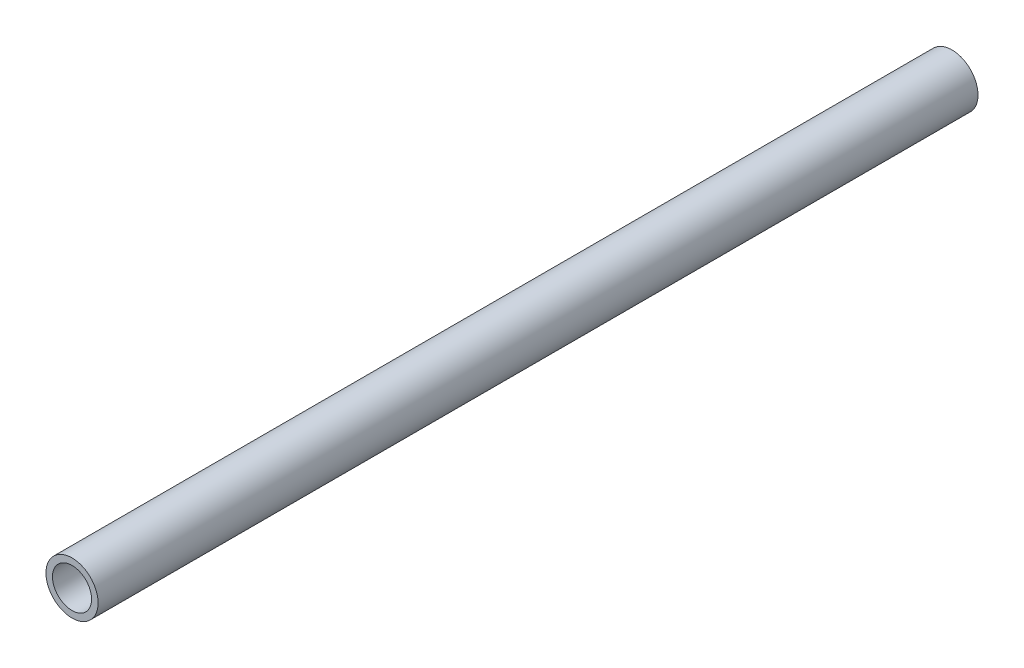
from build123d import *

# Parameters (mm, degrees)
ESQUISSE1_R      = 4
ESQUISSE1_R_2    = 3
EXTRUSION1_DEPTH = 135


with BuildPart() as part:
    # Esquisse1 → Extrusion1 (new body)
    with BuildSketch(Plane.XY):
        Circle(ESQUISSE1_R)
        Circle(ESQUISSE1_R_2, mode=Mode.SUBTRACT)
    extrude(amount=-EXTRUSION1_DEPTH)


solid = part.part
